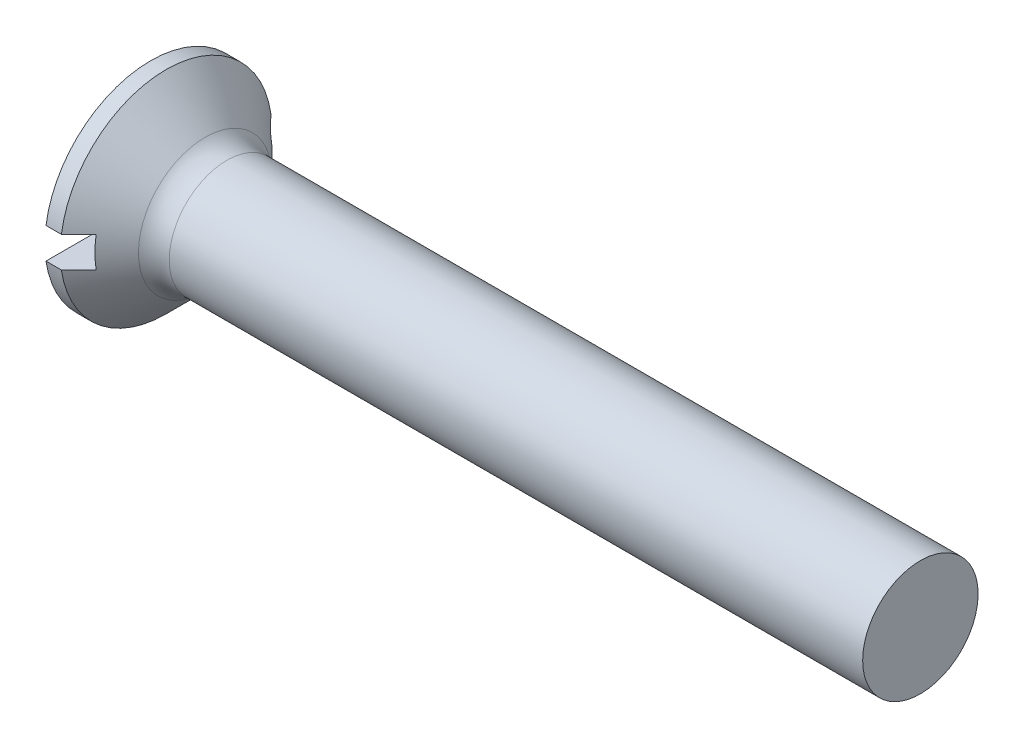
from build123d import *

# Parameters (mm, degrees)
FILLET1_R  = 0.8
SKETCH2_W  = 5.5
SKETCH2_H  = 0.8
SLOT_DEPTH = 0.85


with BuildPart() as part:
    # BodySke → Base-Revolve (revolve)
    with BuildSketch(Plane.XY, mode=Mode.PRIVATE) as base_revolve_sk:
        Polygon((0, 0), (0, 2.75), (0.4, 2.75), (1.65, 1.5), (20, 1.5), (20, 0), align=None)
    revolve(base_revolve_sk.sketch.rotate(Axis((-6.35, 0, 0), (1, 0, 0)), 90), axis=Axis((-6.35, 0, 0), (1, 0, 0)))

    # Fillet1
    fillet1_edges = [part.edges().sort_by_distance(p)[0] for p in [
        (1.65, 0, -1.5),
    ]]
    fillet(fillet1_edges, radius=FILLET1_R)

    # Sketch2 → Slot (cut)
    with BuildSketch(Plane.ZY):
        Rectangle(SKETCH2_W, SKETCH2_H)
    extrude(amount=-SLOT_DEPTH, mode=Mode.SUBTRACT)


solid = part.part
